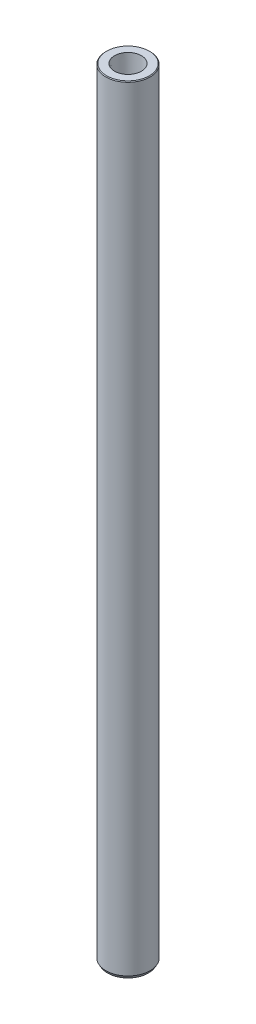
from build123d import *

# Parameters (mm, degrees)
SKETCH1_R          = 7.5
EXTRUDE1_DEPTH     = 264
CHAMFER1_SIZE      = 1
CHAMFER1_SIZE2     = 0.577350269
SKETCH2_R          = 4.5
CUT_EXTRUDE1_DEPTH = 17
CHAMFER2_SIZE      = 0.25
SKETCH5_R          = 4
CUT_EXTRUDE2_DEPTH = 200
CHAMFER3_SIZE      = 0.25


with BuildPart() as part:
    # Sketch1 → Extrude1 (new body)
    with BuildSketch(Plane(origin=(0, 0, 0), x_dir=(1, 0, 0), z_dir=(0, 1, 0))):
        with Locations(Location((0, 0, 0), (0, 0, 270))):
            Circle(SKETCH1_R)
    extrude(amount=EXTRUDE1_DEPTH)

    # Chamfer1
    chamfer1_edges = [part.edges().sort_by_distance(p)[0] for p in [
        (0, 0, -7.5),
    ]]
    chamfer1_side = [part.faces().sort_by_distance(p)[0] for p in [
        (0, 132, -7.5),
    ]]
    chamfer(chamfer1_edges, length=CHAMFER1_SIZE, length2=CHAMFER1_SIZE2, reference=chamfer1_side[0])

    # Sketch2 → Cut-Extrude1 (cut)
    with BuildSketch(Plane.XZ):
        with Locations(Location((0, 0, 0), (0, 0, 270))):
            Circle(SKETCH2_R)
    extrude(amount=-CUT_EXTRUDE1_DEPTH, mode=Mode.SUBTRACT)

    # Chamfer2
    chamfer2_edges = [part.edges().sort_by_distance(p)[0] for p in [
        (0, 264, -7.5),
    ]]
    chamfer(chamfer2_edges, length=CHAMFER2_SIZE)

    # Sketch5 → Cut-Extrude2 (cut)
    with BuildSketch(Plane(origin=(0, 264, 0), x_dir=(-1, 0, 0), z_dir=(0, 1, 0))):
        with Locations(Location((0, 0, 0), (0, 0, 90))):
            Circle(SKETCH5_R)
    extrude(amount=-CUT_EXTRUDE2_DEPTH, mode=Mode.SUBTRACT)

    # Chamfer3
    chamfer3_edges = [part.edges().sort_by_distance(p)[0] for p in [
        (0, 0, 4.5),
    ]]
    chamfer(chamfer3_edges, length=CHAMFER3_SIZE)

    # Sketch7 → 1_8 Rc Tapped Hole1 (revolve, cut)
    with BuildSketch(Plane(origin=(0, 264, 0), x_dir=(0, 0, 1), z_dir=(1, 0, 0))):
        Polygon((0, 0), (0, 14.308399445), (3.95, 11.935), (3.95, 7.4), (4.342497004, 7.4), (4.5735, 0), align=None)
    revolve(axis=Axis((0, 270.35, 0), (0, -1, 0)), mode=Mode.SUBTRACT)


solid = part.part
